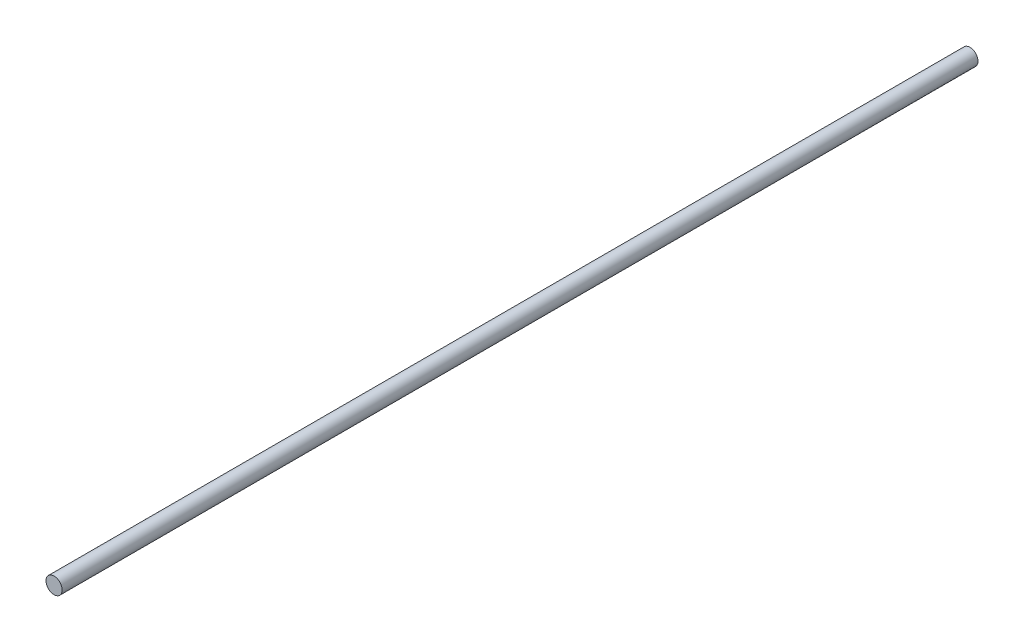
ISO-10303-21;
HEADER;
FILE_DESCRIPTION(('STEP AP214'),'2;1');
FILE_NAME('part.step','',(''),(''),'','','');
FILE_SCHEMA(('AUTOMOTIVE_DESIGN { 1 0 10303 214 1 1 1 1 }'));
ENDSEC;
DATA;
#1=APPLICATION_CONTEXT('core data for automotive mechanical design processes');
#2=APPLICATION_PROTOCOL_DEFINITION('international standard','automotive_design',2000,#1);
#3=PRODUCT_CONTEXT('',#1,'mechanical');
#4=PRODUCT('Part','Part','',(#3));
#5=PRODUCT_RELATED_PRODUCT_CATEGORY('part','',(#4));
#6=PRODUCT_DEFINITION_FORMATION('','',#4);
#7=PRODUCT_DEFINITION_CONTEXT('part definition',#1,'design');
#8=PRODUCT_DEFINITION('design','',#6,#7);
#9=PRODUCT_DEFINITION_SHAPE('','',#8);
#10=(LENGTH_UNIT() NAMED_UNIT(*) SI_UNIT(.MILLI.,.METRE.));
#11=(NAMED_UNIT(*) PLANE_ANGLE_UNIT() SI_UNIT($,.RADIAN.));
#12=(NAMED_UNIT(*) SI_UNIT($,.STERADIAN.) SOLID_ANGLE_UNIT());
#13=UNCERTAINTY_MEASURE_WITH_UNIT(LENGTH_MEASURE(1.E-05),#10,'distance_accuracy_value','');
#14=(GEOMETRIC_REPRESENTATION_CONTEXT(3) GLOBAL_UNCERTAINTY_ASSIGNED_CONTEXT((#13)) GLOBAL_UNIT_ASSIGNED_CONTEXT((#10,
#11,#12)) REPRESENTATION_CONTEXT('',''));
#15=CARTESIAN_POINT('',(0.,0.,0.));
#16=DIRECTION('',(0.,0.,1.));
#17=DIRECTION('',(1.,0.,0.));
#18=AXIS2_PLACEMENT_3D('',#15,#16,#17);
#19=CARTESIAN_POINT('',(0.,0.,-3400.));
#20=DIRECTION('',(0.,0.,1.));
#21=DIRECTION('',(1.,0.,0.));
#22=AXIS2_PLACEMENT_3D('',#19,#20,#21);
#23=CYLINDRICAL_SURFACE('',#22,30.);
#24=CARTESIAN_POINT('',(0.,0.,-3400.));
#25=DIRECTION('',(0.,0.,1.));
#26=DIRECTION('',(1.,0.,0.));
#27=AXIS2_PLACEMENT_3D('',#24,#25,#26);
#28=CIRCLE('',#27,30.);
#29=CARTESIAN_POINT('',(30.,0.,-3400.));
#30=VERTEX_POINT('',#29);
#31=EDGE_CURVE('E10',#30,#30,#28,.T.);
#32=ORIENTED_EDGE('',*,*,#31,.T.);
#33=EDGE_LOOP('',(#32));
#34=FACE_BOUND('',#33,.T.);
#35=CARTESIAN_POINT('',(0.,0.,0.));
#36=DIRECTION('',(0.,0.,1.));
#37=DIRECTION('',(1.,0.,0.));
#38=AXIS2_PLACEMENT_3D('',#35,#36,#37);
#39=CIRCLE('',#38,30.);
#40=CARTESIAN_POINT('',(30.,0.,0.));
#41=VERTEX_POINT('',#40);
#42=EDGE_CURVE('E40',#41,#41,#39,.T.);
#43=ORIENTED_EDGE('',*,*,#42,.F.);
#44=EDGE_LOOP('',(#43));
#45=FACE_BOUND('',#44,.T.);
#46=ADVANCED_FACE('F37',(#34,#45),#23,.T.);
#47=CARTESIAN_POINT('',(0.,0.,-3400.));
#48=DIRECTION('',(0.,0.,1.));
#49=DIRECTION('',(1.,0.,0.));
#50=AXIS2_PLACEMENT_3D('',#47,#48,#49);
#51=PLANE('',#50);
#52=ORIENTED_EDGE('',*,*,#31,.F.);
#53=EDGE_LOOP('',(#52));
#54=FACE_BOUND('',#53,.T.);
#55=ADVANCED_FACE('F54',(#54),#51,.F.);
#56=CARTESIAN_POINT('',(0.,0.,0.));
#57=DIRECTION('',(0.,0.,1.));
#58=DIRECTION('',(1.,0.,0.));
#59=AXIS2_PLACEMENT_3D('',#56,#57,#58);
#60=PLANE('',#59);
#61=ORIENTED_EDGE('',*,*,#42,.T.);
#62=EDGE_LOOP('',(#61));
#63=FACE_BOUND('',#62,.T.);
#64=ADVANCED_FACE('F51',(#63),#60,.T.);
#65=CLOSED_SHELL('',(#46,#55,#64));
#66=MANIFOLD_SOLID_BREP('B2',#65);
#67=ADVANCED_BREP_SHAPE_REPRESENTATION('',(#18,#66),#14);
#68=SHAPE_DEFINITION_REPRESENTATION(#9,#67);
ENDSEC;
END-ISO-10303-21;
